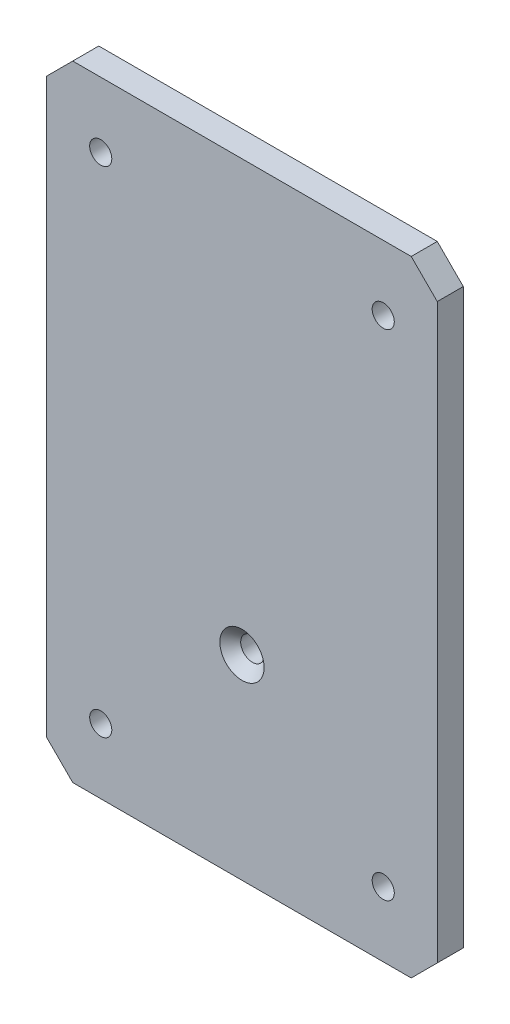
from build123d import *

# Parameters (mm, degrees)
ESQUISSE1_R          = 4.25
ESQUISSE1_R_2        = 4.5
BASE_EXTRUSION_DEPTH = 10
CHANFREIN1_SIZE      = 4


with BuildPart() as part:
    # Esquisse1 → Base-Extrusion (new body)
    with BuildSketch(Plane.XY):
        Polygon((150, 230), (140, 240), (10, 240), (0, 230), (0, 10), (10, 0), (140, 0), (150, 10), align=None)
        with Locations((20.75, 215)):
            Circle(ESQUISSE1_R, mode=Mode.SUBTRACT)
        with Locations((129.25, 215)):
            Circle(ESQUISSE1_R, mode=Mode.SUBTRACT)
        with Locations((20.75, 25)):
            Circle(ESQUISSE1_R, mode=Mode.SUBTRACT)
        with Locations((129.25, 25)):
            Circle(ESQUISSE1_R, mode=Mode.SUBTRACT)
        with Locations((75, 75)):
            Circle(ESQUISSE1_R_2, mode=Mode.SUBTRACT)
    extrude(amount=BASE_EXTRUSION_DEPTH)

    # Chanfrein1
    chanfrein1_edges = [part.edges().sort_by_distance(p)[0] for p in [
        (70.5, 75, 10),
    ]]
    chamfer(chanfrein1_edges, length=CHANFREIN1_SIZE)


solid = part.part
